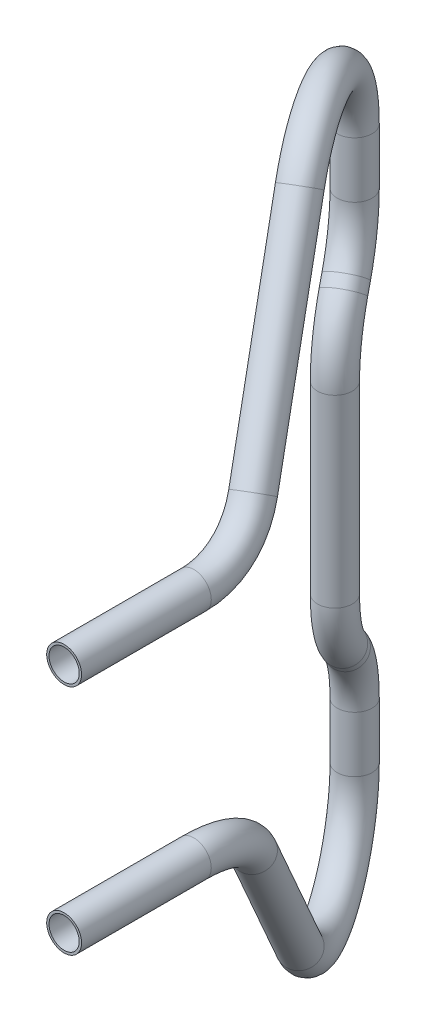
from build123d import *

# Parameters (mm, degrees)
SKETCH_2_R          = 15
SKETCH_2_R_2        = 13
EXTRUDE_1_DEPTH     = 100
SKETCH_4_R          = 15
SKETCH_4_R_2        = 13
SKETCH_5_R          = 15
CUT_EXTRUDE_1_DEPTH = 200
SKETCH_6_R          = 15
SKETCH_8_R          = 15
CUT_EXTRUDE_2_DEPTH = 10.642075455
EXTRUDE_START       = 40
SKETCH_9_R          = 15
EXTRUDE_2_DEPTH     = 40


with BuildPart() as part:
    # Sketch 2 → Extrude 1 (new body)
    with BuildSketch(Plane.XY.offset(8)):
        with Locations((-209.928932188, -106.360389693)):
            Circle(SKETCH_2_R)
        with Locations((-209.928932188, -106.360389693)):
            Circle(SKETCH_2_R_2, mode=Mode.SUBTRACT)
    extrude(amount=-EXTRUDE_1_DEPTH)

    # Sweep 1: sweep along a curve in space
    with BuildLine() as sweep_1_path:
        Line((-209.928932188, -106.360389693, -92), (-209.928932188, -106.360389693, -103.638094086))
        ThreePointArc((-209.928932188, -106.360389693, -103.638094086), (-213.399663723, -115.285127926, -140.307983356), (-222.925586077, -139.780356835, -167.613995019))
        Line((-222.925586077, -139.780356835, -167.613995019), (-281.312437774, -289.917975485, -266.173003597))
        ThreePointArc((-349.928932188, -244.423367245, -382), (-323.940739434, -315.475945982, -338.131039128), (-281.312437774, -289.917975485, -266.173003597))
        Line((-349.928932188, -244.423367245, -382), (-349.928932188, -6.360389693, -382))
    # Sketch 4 → Sweep 1 (sweep)
    with BuildSketch(Plane(origin=(0, 0, -92), x_dir=(-1, 0, 0), z_dir=(0, 0, -1))):
        with Locations((209.928932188, -106.360389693)):
            Circle(SKETCH_4_R)
        with Locations((209.928932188, -106.360389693)):
            Circle(SKETCH_4_R_2, mode=Mode.SUBTRACT)
    sweep(path=sweep_1_path.line)

    # Sketch 5 → Cut-Extrude 1 (cut)
    with BuildSketch(Plane(origin=(0, -6.360389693, 0), x_dir=(1, 0, 0), z_dir=(0, 1, 0))):
        with Locations(Location((-349.928932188, 382, 0), (0, 0, 120.642713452))):
            Circle(SKETCH_5_R)
    extrude(amount=-CUT_EXTRUDE_1_DEPTH, mode=Mode.SUBTRACT)

    # Sweep 2: sweep along a curve in space
    with BuildLine() as sweep_2_path:
        Line((-349.928932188, -206.360389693, -382), (-349.928932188, -196.403248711, -382))
        ThreePointArc((-349.928932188, -196.403248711, -382), (-347.187869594, -168.514653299, -377.372992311), (-339.357784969, -144.625636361, -364.15554086))
        Line((-339.357784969, -144.625636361, -364.15554086), (-335.869257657, -137.45306757, -358.266787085))
        ThreePointArc((-335.869257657, -137.45306757, -358.266787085), (-328.039173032, -113.564050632, -345.049335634), (-325.298110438, -85.675455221, -340.422327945))
        Line((-325.298110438, -85.675455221, -340.422327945), (-325.298110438, -35.718314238, -340.422327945))
    # Sketch 6 → Sweep 2 (sweep)
    with BuildSketch(Plane(origin=(0, -206.360389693, 0), x_dir=(1, 0, 0), z_dir=(0, 1, 0))):
        with Locations((-349.928932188, 382)):
            Circle(SKETCH_6_R)
    sweep(path=sweep_2_path.line)

    # Sketch 8 → Cut-Extrude 2 (cut)
    with BuildSketch(Plane(origin=(0, -35.718314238, 0), x_dir=(1, 0, 0), z_dir=(0, 1, 0))):
        with Locations(Location((-325.298110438, 340.422327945, 0), (0, 0, 300.642713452))):
            Circle(SKETCH_8_R)
    extrude(amount=-CUT_EXTRUDE_2_DEPTH, mode=Mode.SUBTRACT)

    # Sketch 9 → Extrude 2 (add)
    with BuildSketch(Plane(origin=(0, -46.360389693, 0), x_dir=(1, 0, 0), z_dir=(0, 1, 0)).offset(EXTRUDE_START)):
        with Locations(Location((-325.298110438, 340.422327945, 0), (0, 0, 300.642713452))):
            Circle(SKETCH_9_R)
    extrude(amount=-EXTRUDE_2_DEPTH)

    # Mirror 1: part across plane


with BuildPart() as part_1:
    add(part.part)
    add(part.part.mirror(Plane(origin=(-325.298110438, -6.360389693, -340.422327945), x_dir=(0, 0, 1), z_dir=(0, 1, 0))))


solid = part_1.part
